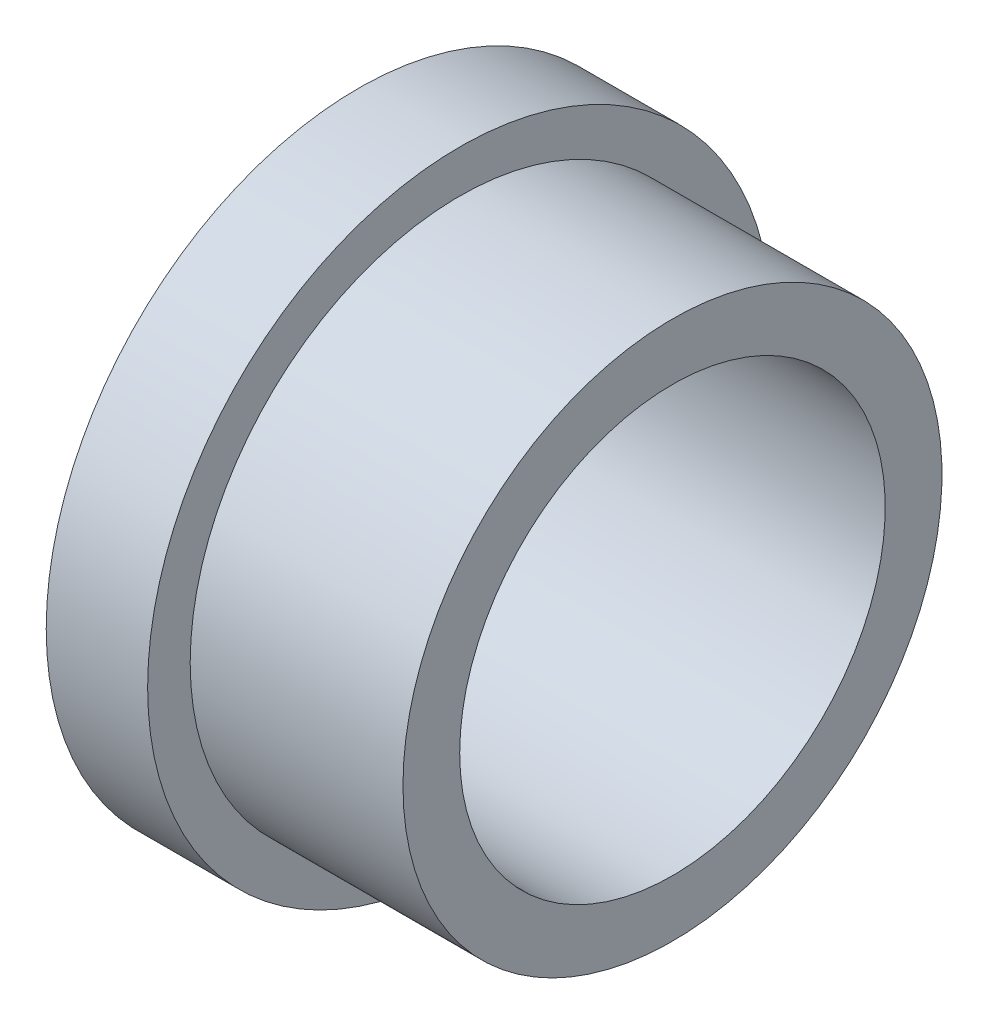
ISO-10303-21;
HEADER;
FILE_DESCRIPTION(('STEP AP214'),'2;1');
FILE_NAME('part.step','',(''),(''),'','','');
FILE_SCHEMA(('AUTOMOTIVE_DESIGN { 1 0 10303 214 1 1 1 1 }'));
ENDSEC;
DATA;
#1=APPLICATION_CONTEXT('core data for automotive mechanical design processes');
#2=APPLICATION_PROTOCOL_DEFINITION('international standard','automotive_design',2000,#1);
#3=PRODUCT_CONTEXT('',#1,'mechanical');
#4=PRODUCT('Part','Part','',(#3));
#5=PRODUCT_RELATED_PRODUCT_CATEGORY('part','',(#4));
#6=PRODUCT_DEFINITION_FORMATION('','',#4);
#7=PRODUCT_DEFINITION_CONTEXT('part definition',#1,'design');
#8=PRODUCT_DEFINITION('design','',#6,#7);
#9=PRODUCT_DEFINITION_SHAPE('','',#8);
#10=(LENGTH_UNIT() NAMED_UNIT(*) SI_UNIT(.MILLI.,.METRE.));
#11=(NAMED_UNIT(*) PLANE_ANGLE_UNIT() SI_UNIT($,.RADIAN.));
#12=(NAMED_UNIT(*) SI_UNIT($,.STERADIAN.) SOLID_ANGLE_UNIT());
#13=UNCERTAINTY_MEASURE_WITH_UNIT(LENGTH_MEASURE(1.E-05),#10,'distance_accuracy_value','');
#14=(GEOMETRIC_REPRESENTATION_CONTEXT(3) GLOBAL_UNCERTAINTY_ASSIGNED_CONTEXT((#13)) GLOBAL_UNIT_ASSIGNED_CONTEXT((#10,
#11,#12)) REPRESENTATION_CONTEXT('',''));
#15=CARTESIAN_POINT('',(0.,0.,0.));
#16=DIRECTION('',(0.,0.,1.));
#17=DIRECTION('',(1.,0.,0.));
#18=AXIS2_PLACEMENT_3D('',#15,#16,#17);
#19=CARTESIAN_POINT('',(0.,0.,0.));
#20=DIRECTION('',(-1.,0.,0.));
#21=DIRECTION('',(0.,0.,1.));
#22=AXIS2_PLACEMENT_3D('',#19,#20,#21);
#23=CYLINDRICAL_SURFACE('',#22,22.);
#24=CARTESIAN_POINT('',(18.4990867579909,0.,0.));
#25=DIRECTION('',(-1.,0.,0.));
#26=DIRECTION('',(0.,0.,1.));
#27=AXIS2_PLACEMENT_3D('',#24,#25,#26);
#28=CIRCLE('',#27,22.);
#29=CARTESIAN_POINT('',(18.4990867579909,0.,22.));
#30=VERTEX_POINT('',#29);
#31=EDGE_CURVE('E51',#30,#30,#28,.T.);
#32=ORIENTED_EDGE('',*,*,#31,.F.);
#33=EDGE_LOOP('',(#32));
#34=FACE_BOUND('',#33,.T.);
#35=CARTESIAN_POINT('',(25.6490867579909,0.,0.));
#36=DIRECTION('',(-1.,0.,0.));
#37=DIRECTION('',(0.,0.,1.));
#38=AXIS2_PLACEMENT_3D('',#35,#36,#37);
#39=CIRCLE('',#38,22.);
#40=CARTESIAN_POINT('',(25.6490867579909,0.,22.));
#41=VERTEX_POINT('',#40);
#42=EDGE_CURVE('E10',#41,#41,#39,.T.);
#43=ORIENTED_EDGE('',*,*,#42,.T.);
#44=EDGE_LOOP('',(#43));
#45=FACE_BOUND('',#44,.T.);
#46=ADVANCED_FACE('F29',(#34,#45),#23,.T.);
#47=CARTESIAN_POINT('',(25.6490867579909,22.,0.));
#48=DIRECTION('',(-1.,0.,0.));
#49=DIRECTION('',(0.,0.,1.));
#50=AXIS2_PLACEMENT_3D('',#47,#48,#49);
#51=PLANE('',#50);
#52=ORIENTED_EDGE('',*,*,#42,.F.);
#53=EDGE_LOOP('',(#52));
#54=FACE_BOUND('',#53,.T.);
#55=CARTESIAN_POINT('',(25.6490867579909,0.,0.));
#56=DIRECTION('',(-1.,0.,0.));
#57=DIRECTION('',(0.,0.,1.));
#58=AXIS2_PLACEMENT_3D('',#55,#56,#57);
#59=CIRCLE('',#58,19.);
#60=CARTESIAN_POINT('',(25.6490867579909,0.,19.));
#61=VERTEX_POINT('',#60);
#62=EDGE_CURVE('E35',#61,#61,#59,.T.);
#63=ORIENTED_EDGE('',*,*,#62,.T.);
#64=EDGE_LOOP('',(#63));
#65=FACE_BOUND('',#64,.T.);
#66=ADVANCED_FACE('F58',(#54,#65),#51,.F.);
#67=CARTESIAN_POINT('',(0.,0.,0.));
#68=DIRECTION('',(-1.,0.,0.));
#69=DIRECTION('',(0.,0.,1.));
#70=AXIS2_PLACEMENT_3D('',#67,#68,#69);
#71=CYLINDRICAL_SURFACE('',#70,19.);
#72=ORIENTED_EDGE('',*,*,#62,.F.);
#73=EDGE_LOOP('',(#72));
#74=FACE_BOUND('',#73,.T.);
#75=CARTESIAN_POINT('',(40.6490867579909,0.,0.));
#76=DIRECTION('',(-1.,0.,0.));
#77=DIRECTION('',(0.,0.,1.));
#78=AXIS2_PLACEMENT_3D('',#75,#76,#77);
#79=CIRCLE('',#78,19.);
#80=CARTESIAN_POINT('',(40.6490867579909,0.,19.));
#81=VERTEX_POINT('',#80);
#82=EDGE_CURVE('E39',#81,#81,#79,.T.);
#83=ORIENTED_EDGE('',*,*,#82,.T.);
#84=EDGE_LOOP('',(#83));
#85=FACE_BOUND('',#84,.T.);
#86=ADVANCED_FACE('F62',(#74,#85),#71,.T.);
#87=CARTESIAN_POINT('',(40.6490867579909,19.,0.));
#88=DIRECTION('',(-1.,0.,0.));
#89=DIRECTION('',(0.,0.,1.));
#90=AXIS2_PLACEMENT_3D('',#87,#88,#89);
#91=PLANE('',#90);
#92=ORIENTED_EDGE('',*,*,#82,.F.);
#93=EDGE_LOOP('',(#92));
#94=FACE_BOUND('',#93,.T.);
#95=CARTESIAN_POINT('',(40.6490867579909,0.,0.));
#96=DIRECTION('',(-1.,0.,0.));
#97=DIRECTION('',(0.,0.,1.));
#98=AXIS2_PLACEMENT_3D('',#95,#96,#97);
#99=CIRCLE('',#98,15.);
#100=CARTESIAN_POINT('',(40.6490867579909,0.,15.));
#101=VERTEX_POINT('',#100);
#102=EDGE_CURVE('E43',#101,#101,#99,.T.);
#103=ORIENTED_EDGE('',*,*,#102,.T.);
#104=EDGE_LOOP('',(#103));
#105=FACE_BOUND('',#104,.T.);
#106=ADVANCED_FACE('F67',(#94,#105),#91,.F.);
#107=CARTESIAN_POINT('',(0.,0.,0.));
#108=DIRECTION('',(-1.,0.,0.));
#109=DIRECTION('',(0.,0.,1.));
#110=AXIS2_PLACEMENT_3D('',#107,#108,#109);
#111=CYLINDRICAL_SURFACE('',#110,15.);
#112=ORIENTED_EDGE('',*,*,#102,.F.);
#113=EDGE_LOOP('',(#112));
#114=FACE_BOUND('',#113,.T.);
#115=CARTESIAN_POINT('',(18.4990867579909,0.,0.));
#116=DIRECTION('',(-1.,0.,0.));
#117=DIRECTION('',(0.,0.,1.));
#118=AXIS2_PLACEMENT_3D('',#115,#116,#117);
#119=CIRCLE('',#118,15.);
#120=CARTESIAN_POINT('',(18.4990867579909,0.,15.));
#121=VERTEX_POINT('',#120);
#122=EDGE_CURVE('E48',#121,#121,#119,.T.);
#123=ORIENTED_EDGE('',*,*,#122,.T.);
#124=EDGE_LOOP('',(#123));
#125=FACE_BOUND('',#124,.T.);
#126=ADVANCED_FACE('F73',(#114,#125),#111,.F.);
#127=CARTESIAN_POINT('',(18.4990867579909,22.,0.));
#128=DIRECTION('',(1.,0.,0.));
#129=DIRECTION('',(0.,0.,-1.));
#130=AXIS2_PLACEMENT_3D('',#127,#128,#129);
#131=PLANE('',#130);
#132=ORIENTED_EDGE('',*,*,#122,.F.);
#133=EDGE_LOOP('',(#132));
#134=FACE_BOUND('',#133,.T.);
#135=ORIENTED_EDGE('',*,*,#31,.T.);
#136=EDGE_LOOP('',(#135));
#137=FACE_BOUND('',#136,.T.);
#138=ADVANCED_FACE('F55',(#134,#137),#131,.F.);
#139=CLOSED_SHELL('',(#46,#66,#86,#106,#126,#138));
#140=MANIFOLD_SOLID_BREP('B2',#139);
#141=ADVANCED_BREP_SHAPE_REPRESENTATION('',(#18,#140),#14);
#142=SHAPE_DEFINITION_REPRESENTATION(#9,#141);
ENDSEC;
END-ISO-10303-21;
